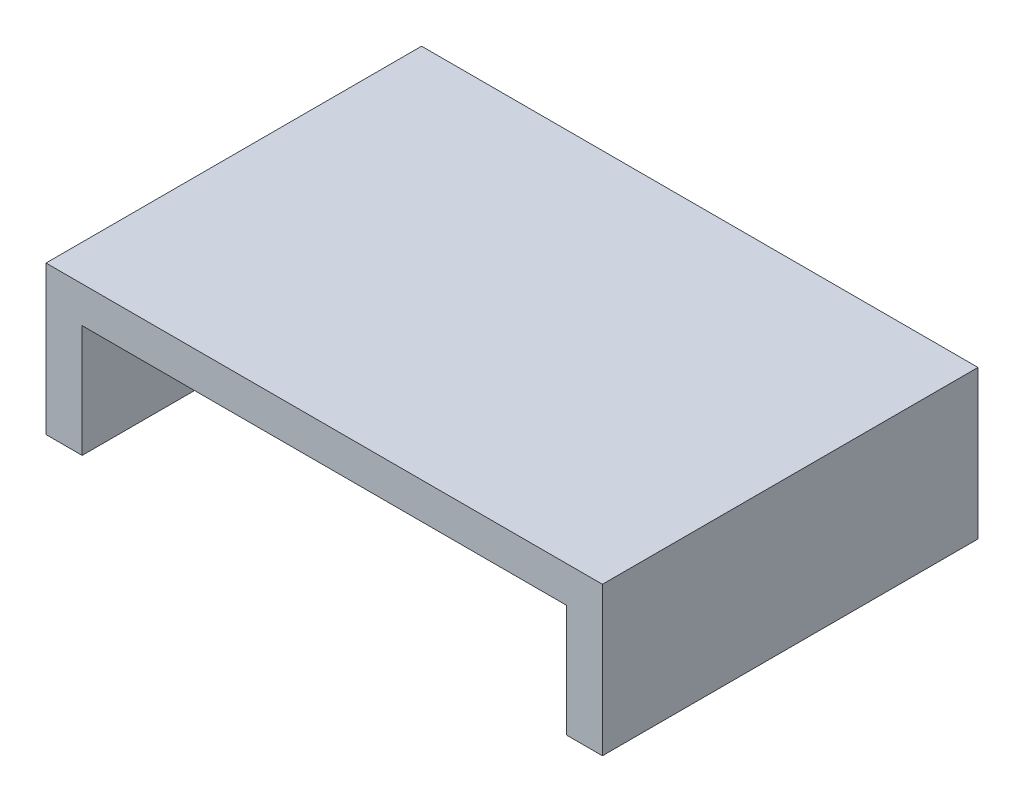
ISO-10303-21;
HEADER;
FILE_DESCRIPTION(('STEP AP214'),'2;1');
FILE_NAME('part.step','',(''),(''),'','','');
FILE_SCHEMA(('AUTOMOTIVE_DESIGN { 1 0 10303 214 1 1 1 1 }'));
ENDSEC;
DATA;
#1=APPLICATION_CONTEXT('core data for automotive mechanical design processes');
#2=APPLICATION_PROTOCOL_DEFINITION('international standard','automotive_design',2000,#1);
#3=PRODUCT_CONTEXT('',#1,'mechanical');
#4=PRODUCT('Part','Part','',(#3));
#5=PRODUCT_RELATED_PRODUCT_CATEGORY('part','',(#4));
#6=PRODUCT_DEFINITION_FORMATION('','',#4);
#7=PRODUCT_DEFINITION_CONTEXT('part definition',#1,'design');
#8=PRODUCT_DEFINITION('design','',#6,#7);
#9=PRODUCT_DEFINITION_SHAPE('','',#8);
#10=(LENGTH_UNIT() NAMED_UNIT(*) SI_UNIT(.MILLI.,.METRE.));
#11=(NAMED_UNIT(*) PLANE_ANGLE_UNIT() SI_UNIT($,.RADIAN.));
#12=(NAMED_UNIT(*) SI_UNIT($,.STERADIAN.) SOLID_ANGLE_UNIT());
#13=UNCERTAINTY_MEASURE_WITH_UNIT(LENGTH_MEASURE(1.E-05),#10,'distance_accuracy_value','');
#14=(GEOMETRIC_REPRESENTATION_CONTEXT(3) GLOBAL_UNCERTAINTY_ASSIGNED_CONTEXT((#13)) GLOBAL_UNIT_ASSIGNED_CONTEXT((#10,
#11,#12)) REPRESENTATION_CONTEXT('',''));
#15=CARTESIAN_POINT('',(0.,0.,0.));
#16=DIRECTION('',(0.,0.,1.));
#17=DIRECTION('',(1.,0.,0.));
#18=AXIS2_PLACEMENT_3D('',#15,#16,#17);
#19=CARTESIAN_POINT('',(10.,-5.34,0.));
#20=DIRECTION('',(0.,-1.,0.));
#21=DIRECTION('',(0.,0.,-1.));
#22=AXIS2_PLACEMENT_3D('',#19,#20,#21);
#23=PLANE('',#22);
#24=DIRECTION('',(1.,0.,0.));
#25=VECTOR('',#24,1.);
#26=CARTESIAN_POINT('',(10.,-5.34,0.));
#27=LINE('',#26,#25);
#28=CARTESIAN_POINT('',(8.7,-5.34,0.));
#29=VERTEX_POINT('',#28);
#30=CARTESIAN_POINT('',(10.,-5.34,0.));
#31=VERTEX_POINT('',#30);
#32=EDGE_CURVE('E19',#29,#31,#27,.T.);
#33=ORIENTED_EDGE('',*,*,#32,.T.);
#34=DIRECTION('',(0.,0.,-1.));
#35=VECTOR('',#34,1.);
#36=CARTESIAN_POINT('',(10.,-5.34,0.));
#37=LINE('',#36,#35);
#38=CARTESIAN_POINT('',(10.,-5.34,13.5));
#39=VERTEX_POINT('',#38);
#40=EDGE_CURVE('E117',#39,#31,#37,.T.);
#41=ORIENTED_EDGE('',*,*,#40,.F.);
#42=DIRECTION('',(1.,0.,0.));
#43=VECTOR('',#42,1.);
#44=CARTESIAN_POINT('',(0.,-5.34,13.5));
#45=LINE('',#44,#43);
#46=CARTESIAN_POINT('',(8.7,-5.34,13.5));
#47=VERTEX_POINT('',#46);
#48=EDGE_CURVE('E143',#47,#39,#45,.T.);
#49=ORIENTED_EDGE('',*,*,#48,.F.);
#50=DIRECTION('',(0.,0.,1.));
#51=VECTOR('',#50,1.);
#52=CARTESIAN_POINT('',(8.7,-5.34,0.));
#53=LINE('',#52,#51);
#54=EDGE_CURVE('E91',#29,#47,#53,.T.);
#55=ORIENTED_EDGE('',*,*,#54,.F.);
#56=EDGE_LOOP('',(#33,#41,#49,#55));
#57=FACE_BOUND('',#56,.T.);
#58=ADVANCED_FACE('F16',(#57),#23,.T.);
#59=CARTESIAN_POINT('',(-8.7,-1.3,0.));
#60=DIRECTION('',(1.,0.,0.));
#61=DIRECTION('',(0.,0.,-1.));
#62=AXIS2_PLACEMENT_3D('',#59,#60,#61);
#63=PLANE('',#62);
#64=DIRECTION('',(0.,1.,0.));
#65=VECTOR('',#64,1.);
#66=CARTESIAN_POINT('',(-8.7,-1.5630565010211,0.));
#67=LINE('',#66,#65);
#68=CARTESIAN_POINT('',(-8.7,-5.34,0.));
#69=VERTEX_POINT('',#68);
#70=CARTESIAN_POINT('',(-8.7,-1.3,0.));
#71=VERTEX_POINT('',#70);
#72=EDGE_CURVE('E139',#69,#71,#67,.T.);
#73=ORIENTED_EDGE('',*,*,#72,.T.);
#74=DIRECTION('',(0.,0.,-1.));
#75=VECTOR('',#74,1.);
#76=CARTESIAN_POINT('',(-8.7,-1.3,0.));
#77=LINE('',#76,#75);
#78=CARTESIAN_POINT('',(-8.7,-1.3,13.5));
#79=VERTEX_POINT('',#78);
#80=EDGE_CURVE('E78',#79,#71,#77,.T.);
#81=ORIENTED_EDGE('',*,*,#80,.F.);
#82=DIRECTION('',(0.,1.,0.));
#83=VECTOR('',#82,1.);
#84=CARTESIAN_POINT('',(-8.7,-1.5630565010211,13.5));
#85=LINE('',#84,#83);
#86=CARTESIAN_POINT('',(-8.7,-5.34,13.5));
#87=VERTEX_POINT('',#86);
#88=EDGE_CURVE('E94',#87,#79,#85,.T.);
#89=ORIENTED_EDGE('',*,*,#88,.F.);
#90=DIRECTION('',(0.,0.,-1.));
#91=VECTOR('',#90,1.);
#92=CARTESIAN_POINT('',(-8.7,-5.34,0.));
#93=LINE('',#92,#91);
#94=EDGE_CURVE('E83',#69,#87,#93,.F.);
#95=ORIENTED_EDGE('',*,*,#94,.F.);
#96=EDGE_LOOP('',(#73,#81,#89,#95));
#97=FACE_BOUND('',#96,.T.);
#98=ADVANCED_FACE('F95',(#97),#63,.T.);
#99=CARTESIAN_POINT('',(8.7,-1.3,0.));
#100=DIRECTION('',(0.,-1.,0.));
#101=DIRECTION('',(0.,0.,-1.));
#102=AXIS2_PLACEMENT_3D('',#99,#100,#101);
#103=PLANE('',#102);
#104=DIRECTION('',(1.,0.,0.));
#105=VECTOR('',#104,1.);
#106=CARTESIAN_POINT('',(0.,-1.3,0.));
#107=LINE('',#106,#105);
#108=CARTESIAN_POINT('',(8.7,-1.3,0.));
#109=VERTEX_POINT('',#108);
#110=EDGE_CURVE('E134',#71,#109,#107,.T.);
#111=ORIENTED_EDGE('',*,*,#110,.T.);
#112=DIRECTION('',(0.,0.,1.));
#113=VECTOR('',#112,1.);
#114=CARTESIAN_POINT('',(8.7,-1.3,0.));
#115=LINE('',#114,#113);
#116=CARTESIAN_POINT('',(8.7,-1.3,13.5));
#117=VERTEX_POINT('',#116);
#118=EDGE_CURVE('E108',#117,#109,#115,.F.);
#119=ORIENTED_EDGE('',*,*,#118,.F.);
#120=DIRECTION('',(1.,0.,0.));
#121=VECTOR('',#120,1.);
#122=CARTESIAN_POINT('',(0.,-1.3,13.5));
#123=LINE('',#122,#121);
#124=EDGE_CURVE('E98',#79,#117,#123,.T.);
#125=ORIENTED_EDGE('',*,*,#124,.F.);
#126=ORIENTED_EDGE('',*,*,#80,.T.);
#127=EDGE_LOOP('',(#111,#119,#125,#126));
#128=FACE_BOUND('',#127,.T.);
#129=ADVANCED_FACE('F148',(#128),#103,.T.);
#130=CARTESIAN_POINT('',(8.7,-5.34,0.));
#131=DIRECTION('',(-1.,0.,0.));
#132=DIRECTION('',(0.,0.,1.));
#133=AXIS2_PLACEMENT_3D('',#130,#131,#132);
#134=PLANE('',#133);
#135=DIRECTION('',(0.,1.,0.));
#136=VECTOR('',#135,1.);
#137=CARTESIAN_POINT('',(8.7,-1.5630565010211,0.));
#138=LINE('',#137,#136);
#139=EDGE_CURVE('E131',#109,#29,#138,.F.);
#140=ORIENTED_EDGE('',*,*,#139,.T.);
#141=ORIENTED_EDGE('',*,*,#54,.T.);
#142=DIRECTION('',(0.,1.,0.));
#143=VECTOR('',#142,1.);
#144=CARTESIAN_POINT('',(8.7,-1.5630565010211,13.5));
#145=LINE('',#144,#143);
#146=EDGE_CURVE('E145',#117,#47,#145,.F.);
#147=ORIENTED_EDGE('',*,*,#146,.F.);
#148=ORIENTED_EDGE('',*,*,#118,.T.);
#149=EDGE_LOOP('',(#140,#141,#147,#148));
#150=FACE_BOUND('',#149,.T.);
#151=ADVANCED_FACE('F150',(#150),#134,.T.);
#152=CARTESIAN_POINT('',(-8.7,-5.34,0.));
#153=DIRECTION('',(0.,-1.,0.));
#154=DIRECTION('',(0.,0.,-1.));
#155=AXIS2_PLACEMENT_3D('',#152,#153,#154);
#156=PLANE('',#155);
#157=DIRECTION('',(1.,0.,0.));
#158=VECTOR('',#157,1.);
#159=CARTESIAN_POINT('',(0.,-5.34,0.));
#160=LINE('',#159,#158);
#161=CARTESIAN_POINT('',(-10.,-5.34,0.));
#162=VERTEX_POINT('',#161);
#163=EDGE_CURVE('E89',#162,#69,#160,.T.);
#164=ORIENTED_EDGE('',*,*,#163,.T.);
#165=ORIENTED_EDGE('',*,*,#94,.T.);
#166=DIRECTION('',(1.,0.,0.));
#167=VECTOR('',#166,1.);
#168=CARTESIAN_POINT('',(0.,-5.34,13.5));
#169=LINE('',#168,#167);
#170=CARTESIAN_POINT('',(-10.,-5.34,13.5));
#171=VERTEX_POINT('',#170);
#172=EDGE_CURVE('E87',#171,#87,#169,.T.);
#173=ORIENTED_EDGE('',*,*,#172,.F.);
#174=DIRECTION('',(0.,0.,1.));
#175=VECTOR('',#174,1.);
#176=CARTESIAN_POINT('',(-10.,-5.34,0.));
#177=LINE('',#176,#175);
#178=EDGE_CURVE('E157',#162,#171,#177,.T.);
#179=ORIENTED_EDGE('',*,*,#178,.F.);
#180=EDGE_LOOP('',(#164,#165,#173,#179));
#181=FACE_BOUND('',#180,.T.);
#182=ADVANCED_FACE('F84',(#181),#156,.T.);
#183=CARTESIAN_POINT('',(0.,-1.5630565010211,13.5));
#184=DIRECTION('',(0.,0.,1.));
#185=DIRECTION('',(1.,0.,0.));
#186=AXIS2_PLACEMENT_3D('',#183,#184,#185);
#187=PLANE('',#186);
#188=ORIENTED_EDGE('',*,*,#48,.T.);
#189=DIRECTION('',(0.,1.,0.));
#190=VECTOR('',#189,1.);
#191=CARTESIAN_POINT('',(10.,0.,13.5));
#192=LINE('',#191,#190);
#193=CARTESIAN_POINT('',(10.,0.,13.5));
#194=VERTEX_POINT('',#193);
#195=EDGE_CURVE('E126',#194,#39,#192,.F.);
#196=ORIENTED_EDGE('',*,*,#195,.F.);
#197=DIRECTION('',(1.,0.,0.));
#198=VECTOR('',#197,1.);
#199=CARTESIAN_POINT('',(-10.,0.,13.5));
#200=LINE('',#199,#198);
#201=CARTESIAN_POINT('',(-10.,0.,13.5));
#202=VERTEX_POINT('',#201);
#203=EDGE_CURVE('E152',#202,#194,#200,.T.);
#204=ORIENTED_EDGE('',*,*,#203,.F.);
#205=DIRECTION('',(0.,1.,0.));
#206=VECTOR('',#205,1.);
#207=CARTESIAN_POINT('',(-10.,-5.34,13.5));
#208=LINE('',#207,#206);
#209=EDGE_CURVE('E102',#171,#202,#208,.T.);
#210=ORIENTED_EDGE('',*,*,#209,.F.);
#211=ORIENTED_EDGE('',*,*,#172,.T.);
#212=ORIENTED_EDGE('',*,*,#88,.T.);
#213=ORIENTED_EDGE('',*,*,#124,.T.);
#214=ORIENTED_EDGE('',*,*,#146,.T.);
#215=EDGE_LOOP('',(#188,#196,#204,#210,#211,#212,#213,#214));
#216=FACE_BOUND('',#215,.T.);
#217=ADVANCED_FACE('F100',(#216),#187,.T.);
#218=CARTESIAN_POINT('',(10.,0.,0.));
#219=DIRECTION('',(1.,0.,0.));
#220=DIRECTION('',(0.,0.,-1.));
#221=AXIS2_PLACEMENT_3D('',#218,#219,#220);
#222=PLANE('',#221);
#223=DIRECTION('',(0.,1.,0.));
#224=VECTOR('',#223,1.);
#225=CARTESIAN_POINT('',(10.,-1.5630565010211,0.));
#226=LINE('',#225,#224);
#227=CARTESIAN_POINT('',(10.,0.,0.));
#228=VERTEX_POINT('',#227);
#229=EDGE_CURVE('E125',#31,#228,#226,.T.);
#230=ORIENTED_EDGE('',*,*,#229,.T.);
#231=DIRECTION('',(0.,0.,1.));
#232=VECTOR('',#231,1.);
#233=CARTESIAN_POINT('',(10.,0.,0.));
#234=LINE('',#233,#232);
#235=EDGE_CURVE('E153',#194,#228,#234,.F.);
#236=ORIENTED_EDGE('',*,*,#235,.F.);
#237=ORIENTED_EDGE('',*,*,#195,.T.);
#238=ORIENTED_EDGE('',*,*,#40,.T.);
#239=EDGE_LOOP('',(#230,#236,#237,#238));
#240=FACE_BOUND('',#239,.T.);
#241=ADVANCED_FACE('F123',(#240),#222,.T.);
#242=CARTESIAN_POINT('',(0.,-1.5630565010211,0.));
#243=DIRECTION('',(0.,0.,1.));
#244=DIRECTION('',(1.,0.,0.));
#245=AXIS2_PLACEMENT_3D('',#242,#243,#244);
#246=PLANE('',#245);
#247=DIRECTION('',(1.,0.,0.));
#248=VECTOR('',#247,1.);
#249=CARTESIAN_POINT('',(-10.,0.,0.));
#250=LINE('',#249,#248);
#251=CARTESIAN_POINT('',(-10.,0.,0.));
#252=VERTEX_POINT('',#251);
#253=EDGE_CURVE('E25',#228,#252,#250,.F.);
#254=ORIENTED_EDGE('',*,*,#253,.F.);
#255=ORIENTED_EDGE('',*,*,#229,.F.);
#256=ORIENTED_EDGE('',*,*,#32,.F.);
#257=ORIENTED_EDGE('',*,*,#139,.F.);
#258=ORIENTED_EDGE('',*,*,#110,.F.);
#259=ORIENTED_EDGE('',*,*,#72,.F.);
#260=ORIENTED_EDGE('',*,*,#163,.F.);
#261=DIRECTION('',(0.,1.,0.));
#262=VECTOR('',#261,1.);
#263=CARTESIAN_POINT('',(-10.,-5.34,0.));
#264=LINE('',#263,#262);
#265=EDGE_CURVE('E34',#252,#162,#264,.F.);
#266=ORIENTED_EDGE('',*,*,#265,.F.);
#267=EDGE_LOOP('',(#254,#255,#256,#257,#258,#259,#260,#266));
#268=FACE_BOUND('',#267,.T.);
#269=ADVANCED_FACE('F128',(#268),#246,.F.);
#270=CARTESIAN_POINT('',(-10.,-5.34,0.));
#271=DIRECTION('',(-1.,0.,0.));
#272=DIRECTION('',(0.,0.,1.));
#273=AXIS2_PLACEMENT_3D('',#270,#271,#272);
#274=PLANE('',#273);
#275=ORIENTED_EDGE('',*,*,#265,.T.);
#276=ORIENTED_EDGE('',*,*,#178,.T.);
#277=ORIENTED_EDGE('',*,*,#209,.T.);
#278=DIRECTION('',(0.,0.,1.));
#279=VECTOR('',#278,1.);
#280=CARTESIAN_POINT('',(-10.,0.,0.));
#281=LINE('',#280,#279);
#282=EDGE_CURVE('E11',#252,#202,#281,.T.);
#283=ORIENTED_EDGE('',*,*,#282,.F.);
#284=EDGE_LOOP('',(#275,#276,#277,#283));
#285=FACE_BOUND('',#284,.T.);
#286=ADVANCED_FACE('F162',(#285),#274,.T.);
#287=CARTESIAN_POINT('',(-10.,0.,0.));
#288=DIRECTION('',(0.,1.,0.));
#289=DIRECTION('',(0.,0.,1.));
#290=AXIS2_PLACEMENT_3D('',#287,#288,#289);
#291=PLANE('',#290);
#292=ORIENTED_EDGE('',*,*,#253,.T.);
#293=ORIENTED_EDGE('',*,*,#282,.T.);
#294=ORIENTED_EDGE('',*,*,#203,.T.);
#295=ORIENTED_EDGE('',*,*,#235,.T.);
#296=EDGE_LOOP('',(#292,#293,#294,#295));
#297=FACE_BOUND('',#296,.T.);
#298=ADVANCED_FACE('F156',(#297),#291,.T.);
#299=CLOSED_SHELL('',(#58,#98,#129,#151,#182,#217,#241,#269,#286,#298));
#300=MANIFOLD_SOLID_BREP('B1',#299);
#301=ADVANCED_BREP_SHAPE_REPRESENTATION('',(#18,#300),#14);
#302=SHAPE_DEFINITION_REPRESENTATION(#9,#301);
ENDSEC;
END-ISO-10303-21;
